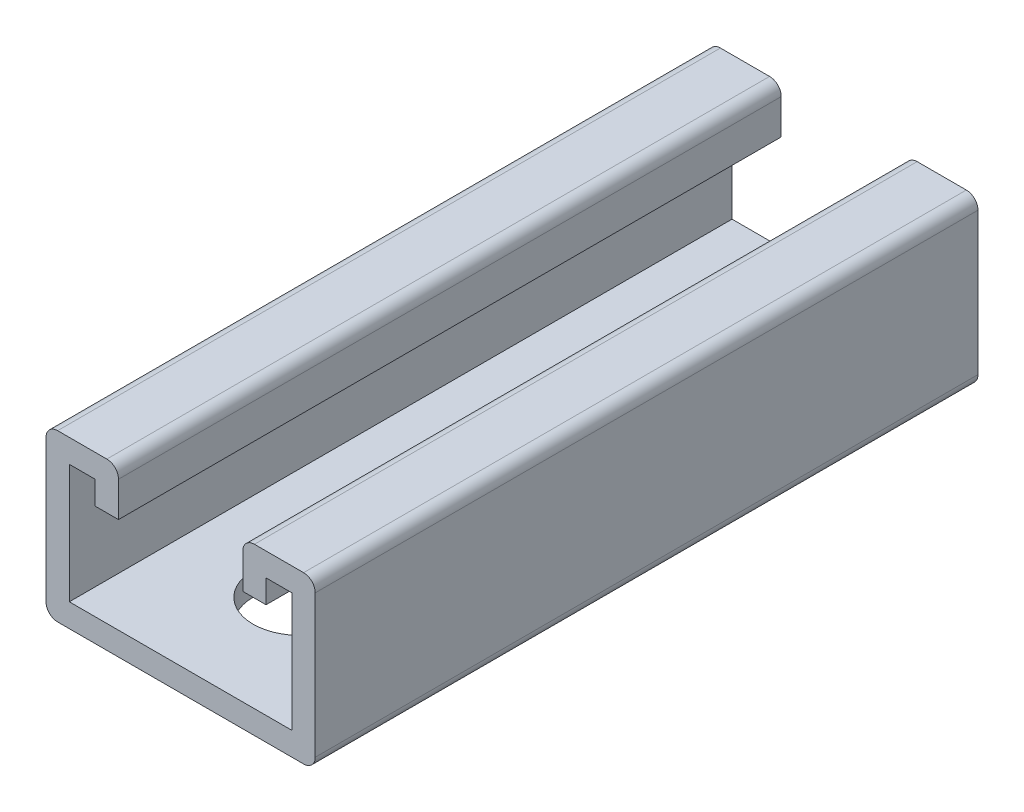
ISO-10303-21;
HEADER;
FILE_DESCRIPTION(('STEP AP214'),'2;1');
FILE_NAME('part.step','',(''),(''),'','','');
FILE_SCHEMA(('AUTOMOTIVE_DESIGN { 1 0 10303 214 1 1 1 1 }'));
ENDSEC;
DATA;
#1=APPLICATION_CONTEXT('core data for automotive mechanical design processes');
#2=APPLICATION_PROTOCOL_DEFINITION('international standard','automotive_design',2000,#1);
#3=PRODUCT_CONTEXT('',#1,'mechanical');
#4=PRODUCT('Part','Part','',(#3));
#5=PRODUCT_RELATED_PRODUCT_CATEGORY('part','',(#4));
#6=PRODUCT_DEFINITION_FORMATION('','',#4);
#7=PRODUCT_DEFINITION_CONTEXT('part definition',#1,'design');
#8=PRODUCT_DEFINITION('design','',#6,#7);
#9=PRODUCT_DEFINITION_SHAPE('','',#8);
#10=(LENGTH_UNIT() NAMED_UNIT(*) SI_UNIT(.MILLI.,.METRE.));
#11=(NAMED_UNIT(*) PLANE_ANGLE_UNIT() SI_UNIT($,.RADIAN.));
#12=(NAMED_UNIT(*) SI_UNIT($,.STERADIAN.) SOLID_ANGLE_UNIT());
#13=UNCERTAINTY_MEASURE_WITH_UNIT(LENGTH_MEASURE(1.E-05),#10,'distance_accuracy_value','');
#14=(GEOMETRIC_REPRESENTATION_CONTEXT(3) GLOBAL_UNCERTAINTY_ASSIGNED_CONTEXT((#13)) GLOBAL_UNIT_ASSIGNED_CONTEXT((#10,
#11,#12)) REPRESENTATION_CONTEXT('',''));
#15=CARTESIAN_POINT('',(0.,0.,0.));
#16=DIRECTION('',(0.,0.,1.));
#17=DIRECTION('',(1.,0.,0.));
#18=AXIS2_PLACEMENT_3D('',#15,#16,#17);
#19=CARTESIAN_POINT('',(9.525,5.55625,101.6));
#20=DIRECTION('',(0.,1.,0.));
#21=DIRECTION('',(0.,0.,1.));
#22=AXIS2_PLACEMENT_3D('',#19,#20,#21);
#23=PLANE('',#22);
#24=DIRECTION('',(1.,0.,0.));
#25=VECTOR('',#24,1.);
#26=CARTESIAN_POINT('',(9.525,5.55625,0.));
#27=LINE('',#26,#25);
#28=CARTESIAN_POINT('',(9.525,5.55625,0.));
#29=VERTEX_POINT('',#28);
#30=CARTESIAN_POINT('',(13.096875,5.55625,0.));
#31=VERTEX_POINT('',#30);
#32=EDGE_CURVE('E296',#29,#31,#27,.T.);
#33=ORIENTED_EDGE('',*,*,#32,.T.);
#34=DIRECTION('',(0.,0.,-1.));
#35=VECTOR('',#34,1.);
#36=CARTESIAN_POINT('',(13.096875,5.55625,101.6));
#37=LINE('',#36,#35);
#38=CARTESIAN_POINT('',(13.096875,5.55625,101.6));
#39=VERTEX_POINT('',#38);
#40=EDGE_CURVE('E11',#39,#31,#37,.T.);
#41=ORIENTED_EDGE('',*,*,#40,.F.);
#42=DIRECTION('',(1.,0.,0.));
#43=VECTOR('',#42,1.);
#44=CARTESIAN_POINT('',(9.525,5.55625,101.6));
#45=LINE('',#44,#43);
#46=CARTESIAN_POINT('',(9.525,5.55625,101.6));
#47=VERTEX_POINT('',#46);
#48=EDGE_CURVE('E297',#47,#39,#45,.T.);
#49=ORIENTED_EDGE('',*,*,#48,.F.);
#50=DIRECTION('',(0.,0.,-1.));
#51=VECTOR('',#50,1.);
#52=CARTESIAN_POINT('',(9.525,5.55625,101.6));
#53=LINE('',#52,#51);
#54=EDGE_CURVE('E343',#47,#29,#53,.T.);
#55=ORIENTED_EDGE('',*,*,#54,.T.);
#56=EDGE_LOOP('',(#33,#41,#49,#55));
#57=FACE_BOUND('',#56,.T.);
#58=ADVANCED_FACE('F33',(#57),#23,.F.);
#59=CARTESIAN_POINT('',(13.096875,9.128125,101.6));
#60=DIRECTION('',(-1.,0.,0.));
#61=DIRECTION('',(0.,0.,1.));
#62=AXIS2_PLACEMENT_3D('',#59,#60,#61);
#63=PLANE('',#62);
#64=DIRECTION('',(0.,1.,0.));
#65=VECTOR('',#64,1.);
#66=CARTESIAN_POINT('',(13.096875,9.128125,0.));
#67=LINE('',#66,#65);
#68=CARTESIAN_POINT('',(13.096875,9.128125,0.));
#69=VERTEX_POINT('',#68);
#70=EDGE_CURVE('E346',#31,#69,#67,.T.);
#71=ORIENTED_EDGE('',*,*,#70,.T.);
#72=DIRECTION('',(0.,0.,-1.));
#73=VECTOR('',#72,1.);
#74=CARTESIAN_POINT('',(13.096875,9.128125,101.6));
#75=LINE('',#74,#73);
#76=CARTESIAN_POINT('',(13.096875,9.128125,101.6));
#77=VERTEX_POINT('',#76);
#78=EDGE_CURVE('E40',#77,#69,#75,.T.);
#79=ORIENTED_EDGE('',*,*,#78,.F.);
#80=DIRECTION('',(0.,1.,0.));
#81=VECTOR('',#80,1.);
#82=CARTESIAN_POINT('',(13.096875,9.128125,101.6));
#83=LINE('',#82,#81);
#84=EDGE_CURVE('E300',#39,#77,#83,.T.);
#85=ORIENTED_EDGE('',*,*,#84,.F.);
#86=ORIENTED_EDGE('',*,*,#40,.T.);
#87=EDGE_LOOP('',(#71,#79,#85,#86));
#88=FACE_BOUND('',#87,.T.);
#89=ADVANCED_FACE('F473',(#88),#63,.F.);
#90=CARTESIAN_POINT('',(17.065625,9.128125,101.6));
#91=DIRECTION('',(0.,1.,0.));
#92=DIRECTION('',(0.,0.,1.));
#93=AXIS2_PLACEMENT_3D('',#90,#91,#92);
#94=PLANE('',#93);
#95=DIRECTION('',(1.,0.,0.));
#96=VECTOR('',#95,1.);
#97=CARTESIAN_POINT('',(17.065625,9.128125,0.));
#98=LINE('',#97,#96);
#99=CARTESIAN_POINT('',(17.065625,9.128125,0.));
#100=VERTEX_POINT('',#99);
#101=EDGE_CURVE('E348',#69,#100,#98,.T.);
#102=ORIENTED_EDGE('',*,*,#101,.T.);
#103=DIRECTION('',(0.,0.,-1.));
#104=VECTOR('',#103,1.);
#105=CARTESIAN_POINT('',(17.065625,9.128125,101.6));
#106=LINE('',#105,#104);
#107=CARTESIAN_POINT('',(17.065625,9.128125,101.6));
#108=VERTEX_POINT('',#107);
#109=EDGE_CURVE('E443',#108,#100,#106,.T.);
#110=ORIENTED_EDGE('',*,*,#109,.F.);
#111=DIRECTION('',(1.,0.,0.));
#112=VECTOR('',#111,1.);
#113=CARTESIAN_POINT('',(17.065625,9.128125,101.6));
#114=LINE('',#113,#112);
#115=EDGE_CURVE('E303',#77,#108,#114,.T.);
#116=ORIENTED_EDGE('',*,*,#115,.F.);
#117=ORIENTED_EDGE('',*,*,#78,.T.);
#118=EDGE_LOOP('',(#102,#110,#116,#117));
#119=FACE_BOUND('',#118,.T.);
#120=ADVANCED_FACE('F450',(#119),#94,.F.);
#121=CARTESIAN_POINT('',(17.065625,-9.128125,101.6));
#122=DIRECTION('',(1.,0.,0.));
#123=DIRECTION('',(0.,1.,0.));
#124=AXIS2_PLACEMENT_3D('',#121,#122,#123);
#125=PLANE('',#124);
#126=DIRECTION('',(0.,-1.,0.));
#127=VECTOR('',#126,1.);
#128=CARTESIAN_POINT('',(17.065625,-9.128125,0.));
#129=LINE('',#128,#127);
#130=CARTESIAN_POINT('',(17.065625,-9.128125,0.));
#131=VERTEX_POINT('',#130);
#132=EDGE_CURVE('E350',#100,#131,#129,.T.);
#133=ORIENTED_EDGE('',*,*,#132,.T.);
#134=DIRECTION('',(0.,0.,-1.));
#135=VECTOR('',#134,1.);
#136=CARTESIAN_POINT('',(17.065625,-9.128125,101.6));
#137=LINE('',#136,#135);
#138=CARTESIAN_POINT('',(17.065625,-9.128125,101.6));
#139=VERTEX_POINT('',#138);
#140=EDGE_CURVE('E440',#139,#131,#137,.T.);
#141=ORIENTED_EDGE('',*,*,#140,.F.);
#142=DIRECTION('',(0.,-1.,0.));
#143=VECTOR('',#142,1.);
#144=CARTESIAN_POINT('',(17.065625,-9.128125,101.6));
#145=LINE('',#144,#143);
#146=EDGE_CURVE('E305',#108,#139,#145,.T.);
#147=ORIENTED_EDGE('',*,*,#146,.F.);
#148=ORIENTED_EDGE('',*,*,#109,.T.);
#149=EDGE_LOOP('',(#133,#141,#147,#148));
#150=FACE_BOUND('',#149,.T.);
#151=ADVANCED_FACE('F461',(#150),#125,.F.);
#152=CARTESIAN_POINT('',(-17.065625,-9.128125,101.6));
#153=DIRECTION('',(0.,-1.,0.));
#154=DIRECTION('',(0.,0.,-1.));
#155=AXIS2_PLACEMENT_3D('',#152,#153,#154);
#156=PLANE('',#155);
#157=DIRECTION('',(0.,0.,1.));
#158=VECTOR('',#157,1.);
#159=CARTESIAN_POINT('',(7.14375,-9.128125,152.4));
#160=LINE('',#159,#158);
#161=CARTESIAN_POINT('',(7.14375,-9.128125,69.05625));
#162=VERTEX_POINT('',#161);
#163=CARTESIAN_POINT('',(7.14375,-9.128125,83.34375));
#164=VERTEX_POINT('',#163);
#165=EDGE_CURVE('E257',#162,#164,#160,.T.);
#166=ORIENTED_EDGE('',*,*,#165,.T.);
#167=CARTESIAN_POINT('',(0.,-9.128125,83.34375));
#168=DIRECTION('',(0.,-1.,0.));
#169=DIRECTION('',(0.,0.,-1.));
#170=AXIS2_PLACEMENT_3D('',#167,#168,#169);
#171=CIRCLE('',#170,7.14375);
#172=CARTESIAN_POINT('',(-7.14375,-9.128125,83.34375));
#173=VERTEX_POINT('',#172);
#174=EDGE_CURVE('E261',#164,#173,#171,.T.);
#175=ORIENTED_EDGE('',*,*,#174,.T.);
#176=DIRECTION('',(0.,0.,-1.));
#177=VECTOR('',#176,1.);
#178=CARTESIAN_POINT('',(-7.14375,-9.128125,152.4));
#179=LINE('',#178,#177);
#180=CARTESIAN_POINT('',(-7.14375,-9.128125,69.05625));
#181=VERTEX_POINT('',#180);
#182=EDGE_CURVE('E238',#173,#181,#179,.T.);
#183=ORIENTED_EDGE('',*,*,#182,.T.);
#184=CARTESIAN_POINT('',(0.,-9.128125,69.05625));
#185=DIRECTION('',(0.,-1.,0.));
#186=DIRECTION('',(0.,0.,-1.));
#187=AXIS2_PLACEMENT_3D('',#184,#185,#186);
#188=CIRCLE('',#187,7.14375);
#189=EDGE_CURVE('E47',#181,#162,#188,.T.);
#190=ORIENTED_EDGE('',*,*,#189,.T.);
#191=EDGE_LOOP('',(#166,#175,#183,#190));
#192=FACE_BOUND('',#191,.T.);
#193=DIRECTION('',(0.,0.,1.));
#194=VECTOR('',#193,1.);
#195=CARTESIAN_POINT('',(7.14375,-9.128125,101.6));
#196=LINE('',#195,#194);
#197=CARTESIAN_POINT('',(7.14375,-9.128125,18.25625));
#198=VERTEX_POINT('',#197);
#199=CARTESIAN_POINT('',(7.14375,-9.128125,32.54375));
#200=VERTEX_POINT('',#199);
#201=EDGE_CURVE('E290',#198,#200,#196,.T.);
#202=ORIENTED_EDGE('',*,*,#201,.T.);
#203=CARTESIAN_POINT('',(0.,-9.128125,32.54375));
#204=DIRECTION('',(0.,-1.,0.));
#205=DIRECTION('',(0.,0.,-1.));
#206=AXIS2_PLACEMENT_3D('',#203,#204,#205);
#207=CIRCLE('',#206,7.14375);
#208=CARTESIAN_POINT('',(-7.14375,-9.128125,32.54375));
#209=VERTEX_POINT('',#208);
#210=EDGE_CURVE('E293',#200,#209,#207,.T.);
#211=ORIENTED_EDGE('',*,*,#210,.T.);
#212=DIRECTION('',(0.,0.,-1.));
#213=VECTOR('',#212,1.);
#214=CARTESIAN_POINT('',(-7.14375,-9.128125,101.6));
#215=LINE('',#214,#213);
#216=CARTESIAN_POINT('',(-7.14375,-9.128125,18.25625));
#217=VERTEX_POINT('',#216);
#218=EDGE_CURVE('E278',#209,#217,#215,.T.);
#219=ORIENTED_EDGE('',*,*,#218,.T.);
#220=CARTESIAN_POINT('',(0.,-9.128125,18.25625));
#221=DIRECTION('',(0.,-1.,0.));
#222=DIRECTION('',(0.,0.,-1.));
#223=AXIS2_PLACEMENT_3D('',#220,#221,#222);
#224=CIRCLE('',#223,7.14375);
#225=EDGE_CURVE('E287',#217,#198,#224,.T.);
#226=ORIENTED_EDGE('',*,*,#225,.T.);
#227=EDGE_LOOP('',(#202,#211,#219,#226));
#228=FACE_BOUND('',#227,.T.);
#229=DIRECTION('',(-1.,0.,0.));
#230=VECTOR('',#229,1.);
#231=CARTESIAN_POINT('',(-17.065625,-9.128125,0.));
#232=LINE('',#231,#230);
#233=CARTESIAN_POINT('',(-17.065625,-9.128125,0.));
#234=VERTEX_POINT('',#233);
#235=EDGE_CURVE('E352',#131,#234,#232,.T.);
#236=ORIENTED_EDGE('',*,*,#235,.T.);
#237=DIRECTION('',(0.,0.,-1.));
#238=VECTOR('',#237,1.);
#239=CARTESIAN_POINT('',(-17.065625,-9.128125,101.6));
#240=LINE('',#239,#238);
#241=CARTESIAN_POINT('',(-17.065625,-9.128125,101.6));
#242=VERTEX_POINT('',#241);
#243=EDGE_CURVE('E437',#242,#234,#240,.T.);
#244=ORIENTED_EDGE('',*,*,#243,.F.);
#245=DIRECTION('',(-1.,0.,0.));
#246=VECTOR('',#245,1.);
#247=CARTESIAN_POINT('',(-17.065625,-9.128125,101.6));
#248=LINE('',#247,#246);
#249=EDGE_CURVE('E307',#139,#242,#248,.T.);
#250=ORIENTED_EDGE('',*,*,#249,.F.);
#251=ORIENTED_EDGE('',*,*,#140,.T.);
#252=EDGE_LOOP('',(#236,#244,#250,#251));
#253=FACE_BOUND('',#252,.T.);
#254=ADVANCED_FACE('F465',(#192,#228,#253),#156,.F.);
#255=CARTESIAN_POINT('',(-17.065625,9.128125,101.6));
#256=DIRECTION('',(-1.,0.,0.));
#257=DIRECTION('',(0.,-1.,0.));
#258=AXIS2_PLACEMENT_3D('',#255,#256,#257);
#259=PLANE('',#258);
#260=DIRECTION('',(0.,1.,0.));
#261=VECTOR('',#260,1.);
#262=CARTESIAN_POINT('',(-17.065625,9.128125,0.));
#263=LINE('',#262,#261);
#264=CARTESIAN_POINT('',(-17.065625,9.128125,0.));
#265=VERTEX_POINT('',#264);
#266=EDGE_CURVE('E354',#234,#265,#263,.T.);
#267=ORIENTED_EDGE('',*,*,#266,.T.);
#268=DIRECTION('',(0.,0.,-1.));
#269=VECTOR('',#268,1.);
#270=CARTESIAN_POINT('',(-17.065625,9.128125,101.6));
#271=LINE('',#270,#269);
#272=CARTESIAN_POINT('',(-17.065625,9.128125,101.6));
#273=VERTEX_POINT('',#272);
#274=EDGE_CURVE('E434',#273,#265,#271,.T.);
#275=ORIENTED_EDGE('',*,*,#274,.F.);
#276=DIRECTION('',(0.,1.,0.));
#277=VECTOR('',#276,1.);
#278=CARTESIAN_POINT('',(-17.065625,9.128125,101.6));
#279=LINE('',#278,#277);
#280=EDGE_CURVE('E309',#242,#273,#279,.T.);
#281=ORIENTED_EDGE('',*,*,#280,.F.);
#282=ORIENTED_EDGE('',*,*,#243,.T.);
#283=EDGE_LOOP('',(#267,#275,#281,#282));
#284=FACE_BOUND('',#283,.T.);
#285=ADVANCED_FACE('F555',(#284),#259,.F.);
#286=CARTESIAN_POINT('',(-13.096875,9.128125,101.6));
#287=DIRECTION('',(0.,1.,0.));
#288=DIRECTION('',(0.,0.,1.));
#289=AXIS2_PLACEMENT_3D('',#286,#287,#288);
#290=PLANE('',#289);
#291=DIRECTION('',(1.,0.,0.));
#292=VECTOR('',#291,1.);
#293=CARTESIAN_POINT('',(-13.096875,9.128125,0.));
#294=LINE('',#293,#292);
#295=CARTESIAN_POINT('',(-13.096875,9.128125,0.));
#296=VERTEX_POINT('',#295);
#297=EDGE_CURVE('E356',#265,#296,#294,.T.);
#298=ORIENTED_EDGE('',*,*,#297,.T.);
#299=DIRECTION('',(0.,0.,-1.));
#300=VECTOR('',#299,1.);
#301=CARTESIAN_POINT('',(-13.096875,9.128125,101.6));
#302=LINE('',#301,#300);
#303=CARTESIAN_POINT('',(-13.096875,9.128125,101.6));
#304=VERTEX_POINT('',#303);
#305=EDGE_CURVE('E431',#304,#296,#302,.T.);
#306=ORIENTED_EDGE('',*,*,#305,.F.);
#307=DIRECTION('',(1.,0.,0.));
#308=VECTOR('',#307,1.);
#309=CARTESIAN_POINT('',(-13.096875,9.128125,101.6));
#310=LINE('',#309,#308);
#311=EDGE_CURVE('E311',#273,#304,#310,.T.);
#312=ORIENTED_EDGE('',*,*,#311,.F.);
#313=ORIENTED_EDGE('',*,*,#274,.T.);
#314=EDGE_LOOP('',(#298,#306,#312,#313));
#315=FACE_BOUND('',#314,.T.);
#316=ADVANCED_FACE('F552',(#315),#290,.F.);
#317=CARTESIAN_POINT('',(-13.096875,9.128125,101.6));
#318=DIRECTION('',(1.,0.,0.));
#319=DIRECTION('',(0.,0.,-1.));
#320=AXIS2_PLACEMENT_3D('',#317,#318,#319);
#321=PLANE('',#320);
#322=DIRECTION('',(0.,-1.,0.));
#323=VECTOR('',#322,1.);
#324=CARTESIAN_POINT('',(-13.096875,9.128125,0.));
#325=LINE('',#324,#323);
#326=CARTESIAN_POINT('',(-13.096875,5.55625,0.));
#327=VERTEX_POINT('',#326);
#328=EDGE_CURVE('E358',#296,#327,#325,.T.);
#329=ORIENTED_EDGE('',*,*,#328,.T.);
#330=DIRECTION('',(0.,0.,-1.));
#331=VECTOR('',#330,1.);
#332=CARTESIAN_POINT('',(-13.096875,5.55625,101.6));
#333=LINE('',#332,#331);
#334=CARTESIAN_POINT('',(-13.096875,5.55625,101.6));
#335=VERTEX_POINT('',#334);
#336=EDGE_CURVE('E428',#335,#327,#333,.T.);
#337=ORIENTED_EDGE('',*,*,#336,.F.);
#338=DIRECTION('',(0.,-1.,0.));
#339=VECTOR('',#338,1.);
#340=CARTESIAN_POINT('',(-13.096875,9.128125,101.6));
#341=LINE('',#340,#339);
#342=EDGE_CURVE('E313',#304,#335,#341,.T.);
#343=ORIENTED_EDGE('',*,*,#342,.F.);
#344=ORIENTED_EDGE('',*,*,#305,.T.);
#345=EDGE_LOOP('',(#329,#337,#343,#344));
#346=FACE_BOUND('',#345,.T.);
#347=ADVANCED_FACE('F548',(#346),#321,.F.);
#348=CARTESIAN_POINT('',(-13.096875,5.55625,101.6));
#349=DIRECTION('',(0.,1.,0.));
#350=DIRECTION('',(0.,0.,1.));
#351=AXIS2_PLACEMENT_3D('',#348,#349,#350);
#352=PLANE('',#351);
#353=DIRECTION('',(1.,0.,0.));
#354=VECTOR('',#353,1.);
#355=CARTESIAN_POINT('',(-13.096875,5.55625,0.));
#356=LINE('',#355,#354);
#357=CARTESIAN_POINT('',(-9.525,5.55625,0.));
#358=VERTEX_POINT('',#357);
#359=EDGE_CURVE('E360',#327,#358,#356,.T.);
#360=ORIENTED_EDGE('',*,*,#359,.T.);
#361=DIRECTION('',(0.,0.,-1.));
#362=VECTOR('',#361,1.);
#363=CARTESIAN_POINT('',(-9.525,5.55625,101.6));
#364=LINE('',#363,#362);
#365=CARTESIAN_POINT('',(-9.525,5.55625,101.6));
#366=VERTEX_POINT('',#365);
#367=EDGE_CURVE('E425',#366,#358,#364,.T.);
#368=ORIENTED_EDGE('',*,*,#367,.F.);
#369=DIRECTION('',(1.,0.,0.));
#370=VECTOR('',#369,1.);
#371=CARTESIAN_POINT('',(-13.096875,5.55625,101.6));
#372=LINE('',#371,#370);
#373=EDGE_CURVE('E315',#335,#366,#372,.T.);
#374=ORIENTED_EDGE('',*,*,#373,.F.);
#375=ORIENTED_EDGE('',*,*,#336,.T.);
#376=EDGE_LOOP('',(#360,#368,#374,#375));
#377=FACE_BOUND('',#376,.T.);
#378=ADVANCED_FACE('F544',(#377),#352,.F.);
#379=CARTESIAN_POINT('',(-9.525,10.9140625,101.6));
#380=DIRECTION('',(-1.,0.,0.));
#381=DIRECTION('',(0.,0.,1.));
#382=AXIS2_PLACEMENT_3D('',#379,#380,#381);
#383=PLANE('',#382);
#384=DIRECTION('',(0.,1.,0.));
#385=VECTOR('',#384,1.);
#386=CARTESIAN_POINT('',(-9.525,10.9140625,0.));
#387=LINE('',#386,#385);
#388=CARTESIAN_POINT('',(-9.525,10.9140625,0.));
#389=VERTEX_POINT('',#388);
#390=EDGE_CURVE('E362',#358,#389,#387,.T.);
#391=ORIENTED_EDGE('',*,*,#390,.T.);
#392=DIRECTION('',(0.,0.,-1.));
#393=VECTOR('',#392,1.);
#394=CARTESIAN_POINT('',(-9.525,10.9140625,101.6));
#395=LINE('',#394,#393);
#396=CARTESIAN_POINT('',(-9.525,10.9140625,101.6));
#397=VERTEX_POINT('',#396);
#398=EDGE_CURVE('E422',#397,#389,#395,.T.);
#399=ORIENTED_EDGE('',*,*,#398,.F.);
#400=DIRECTION('',(0.,1.,0.));
#401=VECTOR('',#400,1.);
#402=CARTESIAN_POINT('',(-9.525,10.9140625,101.6));
#403=LINE('',#402,#401);
#404=EDGE_CURVE('E317',#366,#397,#403,.T.);
#405=ORIENTED_EDGE('',*,*,#404,.F.);
#406=ORIENTED_EDGE('',*,*,#367,.T.);
#407=EDGE_LOOP('',(#391,#399,#405,#406));
#408=FACE_BOUND('',#407,.T.);
#409=ADVANCED_FACE('F539',(#408),#383,.F.);
#410=CARTESIAN_POINT('',(-11.3109375,10.9140625,101.6));
#411=DIRECTION('',(0.,0.,-1.));
#412=DIRECTION('',(-1.,0.,0.));
#413=AXIS2_PLACEMENT_3D('',#410,#411,#412);
#414=CYLINDRICAL_SURFACE('',#413,1.7859375);
#415=CARTESIAN_POINT('',(-11.3109375,10.9140625,0.));
#416=DIRECTION('',(0.,0.,1.));
#417=DIRECTION('',(-1.,0.,0.));
#418=AXIS2_PLACEMENT_3D('',#415,#416,#417);
#419=CIRCLE('',#418,1.7859375);
#420=CARTESIAN_POINT('',(-11.3109375,12.7,0.));
#421=VERTEX_POINT('',#420);
#422=EDGE_CURVE('E364',#389,#421,#419,.T.);
#423=ORIENTED_EDGE('',*,*,#422,.T.);
#424=DIRECTION('',(0.,0.,-1.));
#425=VECTOR('',#424,1.);
#426=CARTESIAN_POINT('',(-11.3109375,12.7,101.6));
#427=LINE('',#426,#425);
#428=CARTESIAN_POINT('',(-11.3109375,12.7,101.6));
#429=VERTEX_POINT('',#428);
#430=EDGE_CURVE('E419',#429,#421,#427,.T.);
#431=ORIENTED_EDGE('',*,*,#430,.F.);
#432=CARTESIAN_POINT('',(-11.3109375,10.9140625,101.6));
#433=DIRECTION('',(0.,0.,1.));
#434=DIRECTION('',(-1.,0.,0.));
#435=AXIS2_PLACEMENT_3D('',#432,#433,#434);
#436=CIRCLE('',#435,1.7859375);
#437=EDGE_CURVE('E319',#397,#429,#436,.T.);
#438=ORIENTED_EDGE('',*,*,#437,.F.);
#439=ORIENTED_EDGE('',*,*,#398,.T.);
#440=EDGE_LOOP('',(#423,#431,#438,#439));
#441=FACE_BOUND('',#440,.T.);
#442=ADVANCED_FACE('F533',(#441),#414,.T.);
#443=CARTESIAN_POINT('',(-11.3109375,12.7,101.6));
#444=DIRECTION('',(0.,-1.,0.));
#445=DIRECTION('',(0.,0.,-1.));
#446=AXIS2_PLACEMENT_3D('',#443,#444,#445);
#447=PLANE('',#446);
#448=DIRECTION('',(-1.,0.,0.));
#449=VECTOR('',#448,1.);
#450=CARTESIAN_POINT('',(-11.3109375,12.7,0.));
#451=LINE('',#450,#449);
#452=CARTESIAN_POINT('',(-18.8515625,12.7,0.));
#453=VERTEX_POINT('',#452);
#454=EDGE_CURVE('E366',#421,#453,#451,.T.);
#455=ORIENTED_EDGE('',*,*,#454,.T.);
#456=DIRECTION('',(0.,0.,-1.));
#457=VECTOR('',#456,1.);
#458=CARTESIAN_POINT('',(-18.8515625,12.7,101.6));
#459=LINE('',#458,#457);
#460=CARTESIAN_POINT('',(-18.8515625,12.7,101.6));
#461=VERTEX_POINT('',#460);
#462=EDGE_CURVE('E416',#461,#453,#459,.T.);
#463=ORIENTED_EDGE('',*,*,#462,.F.);
#464=DIRECTION('',(-1.,0.,0.));
#465=VECTOR('',#464,1.);
#466=CARTESIAN_POINT('',(-11.3109375,12.7,101.6));
#467=LINE('',#466,#465);
#468=EDGE_CURVE('E321',#429,#461,#467,.T.);
#469=ORIENTED_EDGE('',*,*,#468,.F.);
#470=ORIENTED_EDGE('',*,*,#430,.T.);
#471=EDGE_LOOP('',(#455,#463,#469,#470));
#472=FACE_BOUND('',#471,.T.);
#473=ADVANCED_FACE('F529',(#472),#447,.F.);
#474=CARTESIAN_POINT('',(-18.8515625,10.9140625,101.6));
#475=DIRECTION('',(0.,0.,-1.));
#476=DIRECTION('',(-1.,0.,0.));
#477=AXIS2_PLACEMENT_3D('',#474,#475,#476);
#478=CYLINDRICAL_SURFACE('',#477,1.7859375);
#479=CARTESIAN_POINT('',(-18.8515625,10.9140625,0.));
#480=DIRECTION('',(0.,0.,1.));
#481=DIRECTION('',(-1.,0.,0.));
#482=AXIS2_PLACEMENT_3D('',#479,#480,#481);
#483=CIRCLE('',#482,1.7859375);
#484=CARTESIAN_POINT('',(-20.6375,10.9140625,0.));
#485=VERTEX_POINT('',#484);
#486=EDGE_CURVE('E368',#453,#485,#483,.T.);
#487=ORIENTED_EDGE('',*,*,#486,.T.);
#488=DIRECTION('',(0.,0.,-1.));
#489=VECTOR('',#488,1.);
#490=CARTESIAN_POINT('',(-20.6375,10.9140625,101.6));
#491=LINE('',#490,#489);
#492=CARTESIAN_POINT('',(-20.6375,10.9140625,101.6));
#493=VERTEX_POINT('',#492);
#494=EDGE_CURVE('E413',#493,#485,#491,.T.);
#495=ORIENTED_EDGE('',*,*,#494,.F.);
#496=CARTESIAN_POINT('',(-18.8515625,10.9140625,101.6));
#497=DIRECTION('',(0.,0.,1.));
#498=DIRECTION('',(-1.,0.,0.));
#499=AXIS2_PLACEMENT_3D('',#496,#497,#498);
#500=CIRCLE('',#499,1.7859375);
#501=EDGE_CURVE('E323',#461,#493,#500,.T.);
#502=ORIENTED_EDGE('',*,*,#501,.F.);
#503=ORIENTED_EDGE('',*,*,#462,.T.);
#504=EDGE_LOOP('',(#487,#495,#502,#503));
#505=FACE_BOUND('',#504,.T.);
#506=ADVANCED_FACE('F524',(#505),#478,.T.);
#507=CARTESIAN_POINT('',(-20.6375,10.9140625,101.6));
#508=DIRECTION('',(1.,0.,0.));
#509=DIRECTION('',(0.,0.,-1.));
#510=AXIS2_PLACEMENT_3D('',#507,#508,#509);
#511=PLANE('',#510);
#512=DIRECTION('',(0.,-1.,0.));
#513=VECTOR('',#512,1.);
#514=CARTESIAN_POINT('',(-20.6375,10.9140625,0.));
#515=LINE('',#514,#513);
#516=CARTESIAN_POINT('',(-20.6375,-10.9140625,0.));
#517=VERTEX_POINT('',#516);
#518=EDGE_CURVE('E370',#485,#517,#515,.T.);
#519=ORIENTED_EDGE('',*,*,#518,.T.);
#520=DIRECTION('',(0.,0.,-1.));
#521=VECTOR('',#520,1.);
#522=CARTESIAN_POINT('',(-20.6375,-10.9140625,101.6));
#523=LINE('',#522,#521);
#524=CARTESIAN_POINT('',(-20.6375,-10.9140625,101.6));
#525=VERTEX_POINT('',#524);
#526=EDGE_CURVE('E410',#525,#517,#523,.T.);
#527=ORIENTED_EDGE('',*,*,#526,.F.);
#528=DIRECTION('',(0.,-1.,0.));
#529=VECTOR('',#528,1.);
#530=CARTESIAN_POINT('',(-20.6375,10.9140625,101.6));
#531=LINE('',#530,#529);
#532=EDGE_CURVE('E325',#493,#525,#531,.T.);
#533=ORIENTED_EDGE('',*,*,#532,.F.);
#534=ORIENTED_EDGE('',*,*,#494,.T.);
#535=EDGE_LOOP('',(#519,#527,#533,#534));
#536=FACE_BOUND('',#535,.T.);
#537=ADVANCED_FACE('F518',(#536),#511,.F.);
#538=CARTESIAN_POINT('',(-18.8515625,-10.9140625,101.6));
#539=DIRECTION('',(0.,0.,-1.));
#540=DIRECTION('',(-1.,0.,0.));
#541=AXIS2_PLACEMENT_3D('',#538,#539,#540);
#542=CYLINDRICAL_SURFACE('',#541,1.7859375);
#543=CARTESIAN_POINT('',(-18.8515625,-10.9140625,0.));
#544=DIRECTION('',(0.,0.,1.));
#545=DIRECTION('',(-1.,0.,0.));
#546=AXIS2_PLACEMENT_3D('',#543,#544,#545);
#547=CIRCLE('',#546,1.7859375);
#548=CARTESIAN_POINT('',(-18.8515625,-12.7,0.));
#549=VERTEX_POINT('',#548);
#550=EDGE_CURVE('E372',#517,#549,#547,.T.);
#551=ORIENTED_EDGE('',*,*,#550,.T.);
#552=DIRECTION('',(0.,0.,-1.));
#553=VECTOR('',#552,1.);
#554=CARTESIAN_POINT('',(-18.8515625,-12.7,101.6));
#555=LINE('',#554,#553);
#556=CARTESIAN_POINT('',(-18.8515625,-12.7,101.6));
#557=VERTEX_POINT('',#556);
#558=EDGE_CURVE('E407',#557,#549,#555,.T.);
#559=ORIENTED_EDGE('',*,*,#558,.F.);
#560=CARTESIAN_POINT('',(-18.8515625,-10.9140625,101.6));
#561=DIRECTION('',(0.,0.,1.));
#562=DIRECTION('',(-1.,0.,0.));
#563=AXIS2_PLACEMENT_3D('',#560,#561,#562);
#564=CIRCLE('',#563,1.7859375);
#565=EDGE_CURVE('E327',#525,#557,#564,.T.);
#566=ORIENTED_EDGE('',*,*,#565,.F.);
#567=ORIENTED_EDGE('',*,*,#526,.T.);
#568=EDGE_LOOP('',(#551,#559,#566,#567));
#569=FACE_BOUND('',#568,.T.);
#570=ADVANCED_FACE('F514',(#569),#542,.T.);
#571=CARTESIAN_POINT('',(-18.8515625,-12.7,101.6));
#572=DIRECTION('',(0.,1.,0.));
#573=DIRECTION('',(-1.,0.,0.));
#574=AXIS2_PLACEMENT_3D('',#571,#572,#573);
#575=PLANE('',#574);
#576=DIRECTION('',(0.,0.,-1.));
#577=VECTOR('',#576,1.);
#578=CARTESIAN_POINT('',(-7.14375,-12.7,69.05625));
#579=LINE('',#578,#577);
#580=CARTESIAN_POINT('',(-7.14375,-12.7,83.34375));
#581=VERTEX_POINT('',#580);
#582=CARTESIAN_POINT('',(-7.14375,-12.7,69.05625));
#583=VERTEX_POINT('',#582);
#584=EDGE_CURVE('E231',#581,#583,#579,.T.);
#585=ORIENTED_EDGE('',*,*,#584,.F.);
#586=CARTESIAN_POINT('',(0.,-12.7,83.34375));
#587=DIRECTION('',(0.,-1.,0.));
#588=DIRECTION('',(1.,0.,0.));
#589=AXIS2_PLACEMENT_3D('',#586,#587,#588);
#590=CIRCLE('',#589,7.14375);
#591=CARTESIAN_POINT('',(7.14375,-12.7,83.34375));
#592=VERTEX_POINT('',#591);
#593=EDGE_CURVE('E55',#592,#581,#590,.T.);
#594=ORIENTED_EDGE('',*,*,#593,.F.);
#595=DIRECTION('',(0.,0.,1.));
#596=VECTOR('',#595,1.);
#597=CARTESIAN_POINT('',(7.14375,-12.7,83.34375));
#598=LINE('',#597,#596);
#599=CARTESIAN_POINT('',(7.14375,-12.7,69.05625));
#600=VERTEX_POINT('',#599);
#601=EDGE_CURVE('E247',#600,#592,#598,.T.);
#602=ORIENTED_EDGE('',*,*,#601,.F.);
#603=CARTESIAN_POINT('',(0.,-12.7,69.05625));
#604=DIRECTION('',(0.,-1.,0.));
#605=DIRECTION('',(1.,0.,0.));
#606=AXIS2_PLACEMENT_3D('',#603,#604,#605);
#607=CIRCLE('',#606,7.14375);
#608=EDGE_CURVE('E241',#583,#600,#607,.T.);
#609=ORIENTED_EDGE('',*,*,#608,.F.);
#610=EDGE_LOOP('',(#585,#594,#602,#609));
#611=FACE_BOUND('',#610,.T.);
#612=DIRECTION('',(0.,0.,-1.));
#613=VECTOR('',#612,1.);
#614=CARTESIAN_POINT('',(-7.14375,-12.7,18.25625));
#615=LINE('',#614,#613);
#616=CARTESIAN_POINT('',(-7.14375,-12.7,32.54375));
#617=VERTEX_POINT('',#616);
#618=CARTESIAN_POINT('',(-7.14375,-12.7,18.25625));
#619=VERTEX_POINT('',#618);
#620=EDGE_CURVE('E266',#617,#619,#615,.T.);
#621=ORIENTED_EDGE('',*,*,#620,.F.);
#622=CARTESIAN_POINT('',(0.,-12.7,32.54375));
#623=DIRECTION('',(0.,-1.,0.));
#624=DIRECTION('',(1.,0.,0.));
#625=AXIS2_PLACEMENT_3D('',#622,#623,#624);
#626=CIRCLE('',#625,7.14375);
#627=CARTESIAN_POINT('',(7.14375,-12.7,32.54375));
#628=VERTEX_POINT('',#627);
#629=EDGE_CURVE('E264',#628,#617,#626,.T.);
#630=ORIENTED_EDGE('',*,*,#629,.F.);
#631=DIRECTION('',(0.,0.,1.));
#632=VECTOR('',#631,1.);
#633=CARTESIAN_POINT('',(7.14375,-12.7,32.54375));
#634=LINE('',#633,#632);
#635=CARTESIAN_POINT('',(7.14375,-12.7,18.25625));
#636=VERTEX_POINT('',#635);
#637=EDGE_CURVE('E272',#636,#628,#634,.T.);
#638=ORIENTED_EDGE('',*,*,#637,.F.);
#639=CARTESIAN_POINT('',(0.,-12.7,18.25625));
#640=DIRECTION('',(0.,-1.,0.));
#641=DIRECTION('',(1.,0.,0.));
#642=AXIS2_PLACEMENT_3D('',#639,#640,#641);
#643=CIRCLE('',#642,7.14375);
#644=EDGE_CURVE('E269',#619,#636,#643,.T.);
#645=ORIENTED_EDGE('',*,*,#644,.F.);
#646=EDGE_LOOP('',(#621,#630,#638,#645));
#647=FACE_BOUND('',#646,.T.);
#648=DIRECTION('',(1.,0.,0.));
#649=VECTOR('',#648,1.);
#650=CARTESIAN_POINT('',(-18.8515625,-12.7,0.));
#651=LINE('',#650,#649);
#652=CARTESIAN_POINT('',(18.8515625,-12.7,0.));
#653=VERTEX_POINT('',#652);
#654=EDGE_CURVE('E374',#549,#653,#651,.T.);
#655=ORIENTED_EDGE('',*,*,#654,.T.);
#656=DIRECTION('',(0.,0.,-1.));
#657=VECTOR('',#656,1.);
#658=CARTESIAN_POINT('',(18.8515625,-12.7,101.6));
#659=LINE('',#658,#657);
#660=CARTESIAN_POINT('',(18.8515625,-12.7,101.6));
#661=VERTEX_POINT('',#660);
#662=EDGE_CURVE('E404',#661,#653,#659,.T.);
#663=ORIENTED_EDGE('',*,*,#662,.F.);
#664=DIRECTION('',(1.,0.,0.));
#665=VECTOR('',#664,1.);
#666=CARTESIAN_POINT('',(-18.8515625,-12.7,101.6));
#667=LINE('',#666,#665);
#668=EDGE_CURVE('E329',#557,#661,#667,.T.);
#669=ORIENTED_EDGE('',*,*,#668,.F.);
#670=ORIENTED_EDGE('',*,*,#558,.T.);
#671=EDGE_LOOP('',(#655,#663,#669,#670));
#672=FACE_BOUND('',#671,.T.);
#673=ADVANCED_FACE('F245',(#611,#647,#672),#575,.F.);
#674=CARTESIAN_POINT('',(18.8515625,-10.9140625,101.6));
#675=DIRECTION('',(0.,0.,-1.));
#676=DIRECTION('',(-1.,0.,0.));
#677=AXIS2_PLACEMENT_3D('',#674,#675,#676);
#678=CYLINDRICAL_SURFACE('',#677,1.7859375);
#679=CARTESIAN_POINT('',(18.8515625,-10.9140625,0.));
#680=DIRECTION('',(0.,0.,1.));
#681=DIRECTION('',(-1.,0.,0.));
#682=AXIS2_PLACEMENT_3D('',#679,#680,#681);
#683=CIRCLE('',#682,1.7859375);
#684=CARTESIAN_POINT('',(20.6375,-10.9140625,0.));
#685=VERTEX_POINT('',#684);
#686=EDGE_CURVE('E376',#653,#685,#683,.T.);
#687=ORIENTED_EDGE('',*,*,#686,.T.);
#688=DIRECTION('',(0.,0.,-1.));
#689=VECTOR('',#688,1.);
#690=CARTESIAN_POINT('',(20.6375,-10.9140625,101.6));
#691=LINE('',#690,#689);
#692=CARTESIAN_POINT('',(20.6375,-10.9140625,101.6));
#693=VERTEX_POINT('',#692);
#694=EDGE_CURVE('E401',#693,#685,#691,.T.);
#695=ORIENTED_EDGE('',*,*,#694,.F.);
#696=CARTESIAN_POINT('',(18.8515625,-10.9140625,101.6));
#697=DIRECTION('',(0.,0.,1.));
#698=DIRECTION('',(-1.,0.,0.));
#699=AXIS2_PLACEMENT_3D('',#696,#697,#698);
#700=CIRCLE('',#699,1.7859375);
#701=EDGE_CURVE('E331',#661,#693,#700,.T.);
#702=ORIENTED_EDGE('',*,*,#701,.F.);
#703=ORIENTED_EDGE('',*,*,#662,.T.);
#704=EDGE_LOOP('',(#687,#695,#702,#703));
#705=FACE_BOUND('',#704,.T.);
#706=ADVANCED_FACE('F504',(#705),#678,.T.);
#707=CARTESIAN_POINT('',(20.6375,-10.9140625,101.6));
#708=DIRECTION('',(-1.,0.,0.));
#709=DIRECTION('',(0.,-1.,0.));
#710=AXIS2_PLACEMENT_3D('',#707,#708,#709);
#711=PLANE('',#710);
#712=DIRECTION('',(0.,1.,0.));
#713=VECTOR('',#712,1.);
#714=CARTESIAN_POINT('',(20.6375,-10.9140625,0.));
#715=LINE('',#714,#713);
#716=CARTESIAN_POINT('',(20.6375,10.9140625,0.));
#717=VERTEX_POINT('',#716);
#718=EDGE_CURVE('E378',#685,#717,#715,.T.);
#719=ORIENTED_EDGE('',*,*,#718,.T.);
#720=DIRECTION('',(0.,0.,-1.));
#721=VECTOR('',#720,1.);
#722=CARTESIAN_POINT('',(20.6375,10.9140625,101.6));
#723=LINE('',#722,#721);
#724=CARTESIAN_POINT('',(20.6375,10.9140625,101.6));
#725=VERTEX_POINT('',#724);
#726=EDGE_CURVE('E398',#725,#717,#723,.T.);
#727=ORIENTED_EDGE('',*,*,#726,.F.);
#728=DIRECTION('',(0.,1.,0.));
#729=VECTOR('',#728,1.);
#730=CARTESIAN_POINT('',(20.6375,-10.9140625,101.6));
#731=LINE('',#730,#729);
#732=EDGE_CURVE('E333',#693,#725,#731,.T.);
#733=ORIENTED_EDGE('',*,*,#732,.F.);
#734=ORIENTED_EDGE('',*,*,#694,.T.);
#735=EDGE_LOOP('',(#719,#727,#733,#734));
#736=FACE_BOUND('',#735,.T.);
#737=ADVANCED_FACE('F500',(#736),#711,.F.);
#738=CARTESIAN_POINT('',(18.8515625,10.9140625,101.6));
#739=DIRECTION('',(0.,0.,-1.));
#740=DIRECTION('',(-1.,0.,0.));
#741=AXIS2_PLACEMENT_3D('',#738,#739,#740);
#742=CYLINDRICAL_SURFACE('',#741,1.7859375);
#743=CARTESIAN_POINT('',(18.8515625,10.9140625,0.));
#744=DIRECTION('',(0.,0.,1.));
#745=DIRECTION('',(-1.,0.,0.));
#746=AXIS2_PLACEMENT_3D('',#743,#744,#745);
#747=CIRCLE('',#746,1.7859375);
#748=CARTESIAN_POINT('',(18.8515625,12.7,0.));
#749=VERTEX_POINT('',#748);
#750=EDGE_CURVE('E380',#717,#749,#747,.T.);
#751=ORIENTED_EDGE('',*,*,#750,.T.);
#752=DIRECTION('',(0.,0.,-1.));
#753=VECTOR('',#752,1.);
#754=CARTESIAN_POINT('',(18.8515625,12.7,101.6));
#755=LINE('',#754,#753);
#756=CARTESIAN_POINT('',(18.8515625,12.7,101.6));
#757=VERTEX_POINT('',#756);
#758=EDGE_CURVE('E395',#757,#749,#755,.T.);
#759=ORIENTED_EDGE('',*,*,#758,.F.);
#760=CARTESIAN_POINT('',(18.8515625,10.9140625,101.6));
#761=DIRECTION('',(0.,0.,1.));
#762=DIRECTION('',(-1.,0.,0.));
#763=AXIS2_PLACEMENT_3D('',#760,#761,#762);
#764=CIRCLE('',#763,1.7859375);
#765=EDGE_CURVE('E335',#725,#757,#764,.T.);
#766=ORIENTED_EDGE('',*,*,#765,.F.);
#767=ORIENTED_EDGE('',*,*,#726,.T.);
#768=EDGE_LOOP('',(#751,#759,#766,#767));
#769=FACE_BOUND('',#768,.T.);
#770=ADVANCED_FACE('F495',(#769),#742,.T.);
#771=CARTESIAN_POINT('',(18.8515625,12.7,101.6));
#772=DIRECTION('',(0.,-1.,0.));
#773=DIRECTION('',(0.,0.,-1.));
#774=AXIS2_PLACEMENT_3D('',#771,#772,#773);
#775=PLANE('',#774);
#776=DIRECTION('',(-1.,0.,0.));
#777=VECTOR('',#776,1.);
#778=CARTESIAN_POINT('',(18.8515625,12.7,0.));
#779=LINE('',#778,#777);
#780=CARTESIAN_POINT('',(11.3109375,12.7,0.));
#781=VERTEX_POINT('',#780);
#782=EDGE_CURVE('E382',#749,#781,#779,.T.);
#783=ORIENTED_EDGE('',*,*,#782,.T.);
#784=DIRECTION('',(0.,0.,-1.));
#785=VECTOR('',#784,1.);
#786=CARTESIAN_POINT('',(11.3109375,12.7,101.6));
#787=LINE('',#786,#785);
#788=CARTESIAN_POINT('',(11.3109375,12.7,101.6));
#789=VERTEX_POINT('',#788);
#790=EDGE_CURVE('E392',#789,#781,#787,.T.);
#791=ORIENTED_EDGE('',*,*,#790,.F.);
#792=DIRECTION('',(-1.,0.,0.));
#793=VECTOR('',#792,1.);
#794=CARTESIAN_POINT('',(18.8515625,12.7,101.6));
#795=LINE('',#794,#793);
#796=EDGE_CURVE('E337',#757,#789,#795,.T.);
#797=ORIENTED_EDGE('',*,*,#796,.F.);
#798=ORIENTED_EDGE('',*,*,#758,.T.);
#799=EDGE_LOOP('',(#783,#791,#797,#798));
#800=FACE_BOUND('',#799,.T.);
#801=ADVANCED_FACE('F489',(#800),#775,.F.);
#802=CARTESIAN_POINT('',(11.3109375,10.9140625,101.6));
#803=DIRECTION('',(0.,0.,-1.));
#804=DIRECTION('',(-1.,0.,0.));
#805=AXIS2_PLACEMENT_3D('',#802,#803,#804);
#806=CYLINDRICAL_SURFACE('',#805,1.7859375);
#807=CARTESIAN_POINT('',(11.3109375,10.9140625,0.));
#808=DIRECTION('',(0.,0.,1.));
#809=DIRECTION('',(-1.,0.,0.));
#810=AXIS2_PLACEMENT_3D('',#807,#808,#809);
#811=CIRCLE('',#810,1.7859375);
#812=CARTESIAN_POINT('',(9.525,10.9140625,0.));
#813=VERTEX_POINT('',#812);
#814=EDGE_CURVE('E384',#781,#813,#811,.T.);
#815=ORIENTED_EDGE('',*,*,#814,.T.);
#816=DIRECTION('',(0.,0.,-1.));
#817=VECTOR('',#816,1.);
#818=CARTESIAN_POINT('',(9.525,10.9140625,101.6));
#819=LINE('',#818,#817);
#820=CARTESIAN_POINT('',(9.525,10.9140625,101.6));
#821=VERTEX_POINT('',#820);
#822=EDGE_CURVE('E389',#821,#813,#819,.T.);
#823=ORIENTED_EDGE('',*,*,#822,.F.);
#824=CARTESIAN_POINT('',(11.3109375,10.9140625,101.6));
#825=DIRECTION('',(0.,0.,1.));
#826=DIRECTION('',(-1.,0.,0.));
#827=AXIS2_PLACEMENT_3D('',#824,#825,#826);
#828=CIRCLE('',#827,1.7859375);
#829=EDGE_CURVE('E339',#789,#821,#828,.T.);
#830=ORIENTED_EDGE('',*,*,#829,.F.);
#831=ORIENTED_EDGE('',*,*,#790,.T.);
#832=EDGE_LOOP('',(#815,#823,#830,#831));
#833=FACE_BOUND('',#832,.T.);
#834=ADVANCED_FACE('F485',(#833),#806,.T.);
#835=CARTESIAN_POINT('',(9.525,10.9140625,101.6));
#836=DIRECTION('',(1.,0.,0.));
#837=DIRECTION('',(0.,0.,-1.));
#838=AXIS2_PLACEMENT_3D('',#835,#836,#837);
#839=PLANE('',#838);
#840=DIRECTION('',(0.,-1.,0.));
#841=VECTOR('',#840,1.);
#842=CARTESIAN_POINT('',(9.525,10.9140625,0.));
#843=LINE('',#842,#841);
#844=EDGE_CURVE('E301',#813,#29,#843,.T.);
#845=ORIENTED_EDGE('',*,*,#844,.T.);
#846=ORIENTED_EDGE('',*,*,#54,.F.);
#847=DIRECTION('',(0.,-1.,0.));
#848=VECTOR('',#847,1.);
#849=CARTESIAN_POINT('',(9.525,10.9140625,101.6));
#850=LINE('',#849,#848);
#851=EDGE_CURVE('E341',#821,#47,#850,.T.);
#852=ORIENTED_EDGE('',*,*,#851,.F.);
#853=ORIENTED_EDGE('',*,*,#822,.T.);
#854=EDGE_LOOP('',(#845,#846,#852,#853));
#855=FACE_BOUND('',#854,.T.);
#856=ADVANCED_FACE('F480',(#855),#839,.F.);
#857=CARTESIAN_POINT('',(-11.3109375,10.9140625,101.6));
#858=DIRECTION('',(0.,0.,-1.));
#859=DIRECTION('',(-1.,0.,0.));
#860=AXIS2_PLACEMENT_3D('',#857,#858,#859);
#861=PLANE('',#860);
#862=ORIENTED_EDGE('',*,*,#48,.T.);
#863=ORIENTED_EDGE('',*,*,#84,.T.);
#864=ORIENTED_EDGE('',*,*,#115,.T.);
#865=ORIENTED_EDGE('',*,*,#146,.T.);
#866=ORIENTED_EDGE('',*,*,#249,.T.);
#867=ORIENTED_EDGE('',*,*,#280,.T.);
#868=ORIENTED_EDGE('',*,*,#311,.T.);
#869=ORIENTED_EDGE('',*,*,#342,.T.);
#870=ORIENTED_EDGE('',*,*,#373,.T.);
#871=ORIENTED_EDGE('',*,*,#404,.T.);
#872=ORIENTED_EDGE('',*,*,#437,.T.);
#873=ORIENTED_EDGE('',*,*,#468,.T.);
#874=ORIENTED_EDGE('',*,*,#501,.T.);
#875=ORIENTED_EDGE('',*,*,#532,.T.);
#876=ORIENTED_EDGE('',*,*,#565,.T.);
#877=ORIENTED_EDGE('',*,*,#668,.T.);
#878=ORIENTED_EDGE('',*,*,#701,.T.);
#879=ORIENTED_EDGE('',*,*,#732,.T.);
#880=ORIENTED_EDGE('',*,*,#765,.T.);
#881=ORIENTED_EDGE('',*,*,#796,.T.);
#882=ORIENTED_EDGE('',*,*,#829,.T.);
#883=ORIENTED_EDGE('',*,*,#851,.T.);
#884=EDGE_LOOP('',(#862,#863,#864,#865,#866,#867,#868,#869,#870,#871,#872,#873,#874,#875,#876,
#877,#878,#879,#880,#881,#882,#883));
#885=FACE_BOUND('',#884,.T.);
#886=ADVANCED_FACE('F469',(#885),#861,.F.);
#887=CARTESIAN_POINT('',(-11.3109375,10.9140625,0.));
#888=DIRECTION('',(0.,0.,-1.));
#889=DIRECTION('',(-1.,0.,0.));
#890=AXIS2_PLACEMENT_3D('',#887,#888,#889);
#891=PLANE('',#890);
#892=ORIENTED_EDGE('',*,*,#32,.F.);
#893=ORIENTED_EDGE('',*,*,#844,.F.);
#894=ORIENTED_EDGE('',*,*,#814,.F.);
#895=ORIENTED_EDGE('',*,*,#782,.F.);
#896=ORIENTED_EDGE('',*,*,#750,.F.);
#897=ORIENTED_EDGE('',*,*,#718,.F.);
#898=ORIENTED_EDGE('',*,*,#686,.F.);
#899=ORIENTED_EDGE('',*,*,#654,.F.);
#900=ORIENTED_EDGE('',*,*,#550,.F.);
#901=ORIENTED_EDGE('',*,*,#518,.F.);
#902=ORIENTED_EDGE('',*,*,#486,.F.);
#903=ORIENTED_EDGE('',*,*,#454,.F.);
#904=ORIENTED_EDGE('',*,*,#422,.F.);
#905=ORIENTED_EDGE('',*,*,#390,.F.);
#906=ORIENTED_EDGE('',*,*,#359,.F.);
#907=ORIENTED_EDGE('',*,*,#328,.F.);
#908=ORIENTED_EDGE('',*,*,#297,.F.);
#909=ORIENTED_EDGE('',*,*,#266,.F.);
#910=ORIENTED_EDGE('',*,*,#235,.F.);
#911=ORIENTED_EDGE('',*,*,#132,.F.);
#912=ORIENTED_EDGE('',*,*,#101,.F.);
#913=ORIENTED_EDGE('',*,*,#70,.F.);
#914=EDGE_LOOP('',(#892,#893,#894,#895,#896,#897,#898,#899,#900,#901,#902,#903,#904,#905,#906,
#907,#908,#909,#910,#911,#912,#913));
#915=FACE_BOUND('',#914,.T.);
#916=ADVANCED_FACE('F456',(#915),#891,.T.);
#917=CARTESIAN_POINT('',(0.,12.7,32.54375));
#918=DIRECTION('',(0.,-1.,0.));
#919=DIRECTION('',(1.,0.,0.));
#920=AXIS2_PLACEMENT_3D('',#917,#918,#919);
#921=CYLINDRICAL_SURFACE('',#920,7.14375);
#922=DIRECTION('',(0.,-1.,0.));
#923=VECTOR('',#922,1.);
#924=CARTESIAN_POINT('',(7.14375,12.7,32.54375));
#925=LINE('',#924,#923);
#926=EDGE_CURVE('E276',#200,#628,#925,.T.);
#927=ORIENTED_EDGE('',*,*,#926,.T.);
#928=ORIENTED_EDGE('',*,*,#629,.T.);
#929=DIRECTION('',(0.,-1.,0.));
#930=VECTOR('',#929,1.);
#931=CARTESIAN_POINT('',(-7.14375,12.7,32.54375));
#932=LINE('',#931,#930);
#933=EDGE_CURVE('E275',#209,#617,#932,.T.);
#934=ORIENTED_EDGE('',*,*,#933,.F.);
#935=ORIENTED_EDGE('',*,*,#210,.F.);
#936=EDGE_LOOP('',(#927,#928,#934,#935));
#937=FACE_BOUND('',#936,.T.);
#938=ADVANCED_FACE('F646',(#937),#921,.F.);
#939=CARTESIAN_POINT('',(7.14375,12.7,32.54375));
#940=DIRECTION('',(1.,0.,0.));
#941=DIRECTION('',(0.,1.,0.));
#942=AXIS2_PLACEMENT_3D('',#939,#940,#941);
#943=PLANE('',#942);
#944=DIRECTION('',(0.,-1.,0.));
#945=VECTOR('',#944,1.);
#946=CARTESIAN_POINT('',(7.14375,12.7,18.25625));
#947=LINE('',#946,#945);
#948=EDGE_CURVE('E279',#198,#636,#947,.T.);
#949=ORIENTED_EDGE('',*,*,#948,.T.);
#950=ORIENTED_EDGE('',*,*,#637,.T.);
#951=ORIENTED_EDGE('',*,*,#926,.F.);
#952=ORIENTED_EDGE('',*,*,#201,.F.);
#953=EDGE_LOOP('',(#949,#950,#951,#952));
#954=FACE_BOUND('',#953,.T.);
#955=ADVANCED_FACE('F642',(#954),#943,.F.);
#956=CARTESIAN_POINT('',(0.,12.7,18.25625));
#957=DIRECTION('',(0.,-1.,0.));
#958=DIRECTION('',(1.,0.,0.));
#959=AXIS2_PLACEMENT_3D('',#956,#957,#958);
#960=CYLINDRICAL_SURFACE('',#959,7.14375);
#961=DIRECTION('',(0.,-1.,0.));
#962=VECTOR('',#961,1.);
#963=CARTESIAN_POINT('',(-7.14375,12.7,18.25625));
#964=LINE('',#963,#962);
#965=EDGE_CURVE('E281',#217,#619,#964,.T.);
#966=ORIENTED_EDGE('',*,*,#965,.T.);
#967=ORIENTED_EDGE('',*,*,#644,.T.);
#968=ORIENTED_EDGE('',*,*,#948,.F.);
#969=ORIENTED_EDGE('',*,*,#225,.F.);
#970=EDGE_LOOP('',(#966,#967,#968,#969));
#971=FACE_BOUND('',#970,.T.);
#972=ADVANCED_FACE('F645',(#971),#960,.F.);
#973=CARTESIAN_POINT('',(-7.14375,12.7,18.25625));
#974=DIRECTION('',(-1.,0.,0.));
#975=DIRECTION('',(0.,-1.,0.));
#976=AXIS2_PLACEMENT_3D('',#973,#974,#975);
#977=PLANE('',#976);
#978=ORIENTED_EDGE('',*,*,#933,.T.);
#979=ORIENTED_EDGE('',*,*,#620,.T.);
#980=ORIENTED_EDGE('',*,*,#965,.F.);
#981=ORIENTED_EDGE('',*,*,#218,.F.);
#982=EDGE_LOOP('',(#978,#979,#980,#981));
#983=FACE_BOUND('',#982,.T.);
#984=ADVANCED_FACE('F590',(#983),#977,.F.);
#985=CARTESIAN_POINT('',(0.,12.7,83.34375));
#986=DIRECTION('',(0.,-1.,0.));
#987=DIRECTION('',(1.,0.,0.));
#988=AXIS2_PLACEMENT_3D('',#985,#986,#987);
#989=CYLINDRICAL_SURFACE('',#988,7.14375);
#990=DIRECTION('',(0.,-1.,0.));
#991=VECTOR('',#990,1.);
#992=CARTESIAN_POINT('',(7.14375,12.7,83.34375));
#993=LINE('',#992,#991);
#994=EDGE_CURVE('E255',#164,#592,#993,.T.);
#995=ORIENTED_EDGE('',*,*,#994,.T.);
#996=ORIENTED_EDGE('',*,*,#593,.T.);
#997=DIRECTION('',(0.,-1.,0.));
#998=VECTOR('',#997,1.);
#999=CARTESIAN_POINT('',(-7.14375,12.7,83.34375));
#1000=LINE('',#999,#998);
#1001=EDGE_CURVE('E235',#173,#581,#1000,.T.);
#1002=ORIENTED_EDGE('',*,*,#1001,.F.);
#1003=ORIENTED_EDGE('',*,*,#174,.F.);
#1004=EDGE_LOOP('',(#995,#996,#1002,#1003));
#1005=FACE_BOUND('',#1004,.T.);
#1006=ADVANCED_FACE('F607',(#1005),#989,.F.);
#1007=CARTESIAN_POINT('',(7.14375,12.7,83.34375));
#1008=DIRECTION('',(1.,0.,0.));
#1009=DIRECTION('',(0.,1.,0.));
#1010=AXIS2_PLACEMENT_3D('',#1007,#1008,#1009);
#1011=PLANE('',#1010);
#1012=DIRECTION('',(0.,-1.,0.));
#1013=VECTOR('',#1012,1.);
#1014=CARTESIAN_POINT('',(7.14375,12.7,69.05625));
#1015=LINE('',#1014,#1013);
#1016=EDGE_CURVE('E248',#162,#600,#1015,.T.);
#1017=ORIENTED_EDGE('',*,*,#1016,.T.);
#1018=ORIENTED_EDGE('',*,*,#601,.T.);
#1019=ORIENTED_EDGE('',*,*,#994,.F.);
#1020=ORIENTED_EDGE('',*,*,#165,.F.);
#1021=EDGE_LOOP('',(#1017,#1018,#1019,#1020));
#1022=FACE_BOUND('',#1021,.T.);
#1023=ADVANCED_FACE('F612',(#1022),#1011,.F.);
#1024=CARTESIAN_POINT('',(0.,12.7,69.05625));
#1025=DIRECTION('',(0.,-1.,0.));
#1026=DIRECTION('',(1.,0.,0.));
#1027=AXIS2_PLACEMENT_3D('',#1024,#1025,#1026);
#1028=CYLINDRICAL_SURFACE('',#1027,7.14375);
#1029=DIRECTION('',(0.,-1.,0.));
#1030=VECTOR('',#1029,1.);
#1031=CARTESIAN_POINT('',(-7.14375,12.7,69.05625));
#1032=LINE('',#1031,#1030);
#1033=EDGE_CURVE('E233',#181,#583,#1032,.T.);
#1034=ORIENTED_EDGE('',*,*,#1033,.T.);
#1035=ORIENTED_EDGE('',*,*,#608,.T.);
#1036=ORIENTED_EDGE('',*,*,#1016,.F.);
#1037=ORIENTED_EDGE('',*,*,#189,.F.);
#1038=EDGE_LOOP('',(#1034,#1035,#1036,#1037));
#1039=FACE_BOUND('',#1038,.T.);
#1040=ADVANCED_FACE('F240',(#1039),#1028,.F.);
#1041=CARTESIAN_POINT('',(-7.14375,12.7,69.05625));
#1042=DIRECTION('',(-1.,0.,0.));
#1043=DIRECTION('',(0.,-1.,0.));
#1044=AXIS2_PLACEMENT_3D('',#1041,#1042,#1043);
#1045=PLANE('',#1044);
#1046=ORIENTED_EDGE('',*,*,#1001,.T.);
#1047=ORIENTED_EDGE('',*,*,#584,.T.);
#1048=ORIENTED_EDGE('',*,*,#1033,.F.);
#1049=ORIENTED_EDGE('',*,*,#182,.F.);
#1050=EDGE_LOOP('',(#1046,#1047,#1048,#1049));
#1051=FACE_BOUND('',#1050,.T.);
#1052=ADVANCED_FACE('F232',(#1051),#1045,.F.);
#1053=CLOSED_SHELL('',(#58,#89,#120,#151,#254,#285,#316,#347,#378,#409,#442,#473,#506,#537,#570,
#673,#706,#737,#770,#801,#834,#856,#886,#916,#938,#955,#972,#984,#1006,#1023,#1040,#1052));
#1054=MANIFOLD_SOLID_BREP('B2',#1053);
#1055=ADVANCED_BREP_SHAPE_REPRESENTATION('',(#18,#1054),#14);
#1056=SHAPE_DEFINITION_REPRESENTATION(#9,#1055);
ENDSEC;
END-ISO-10303-21;
